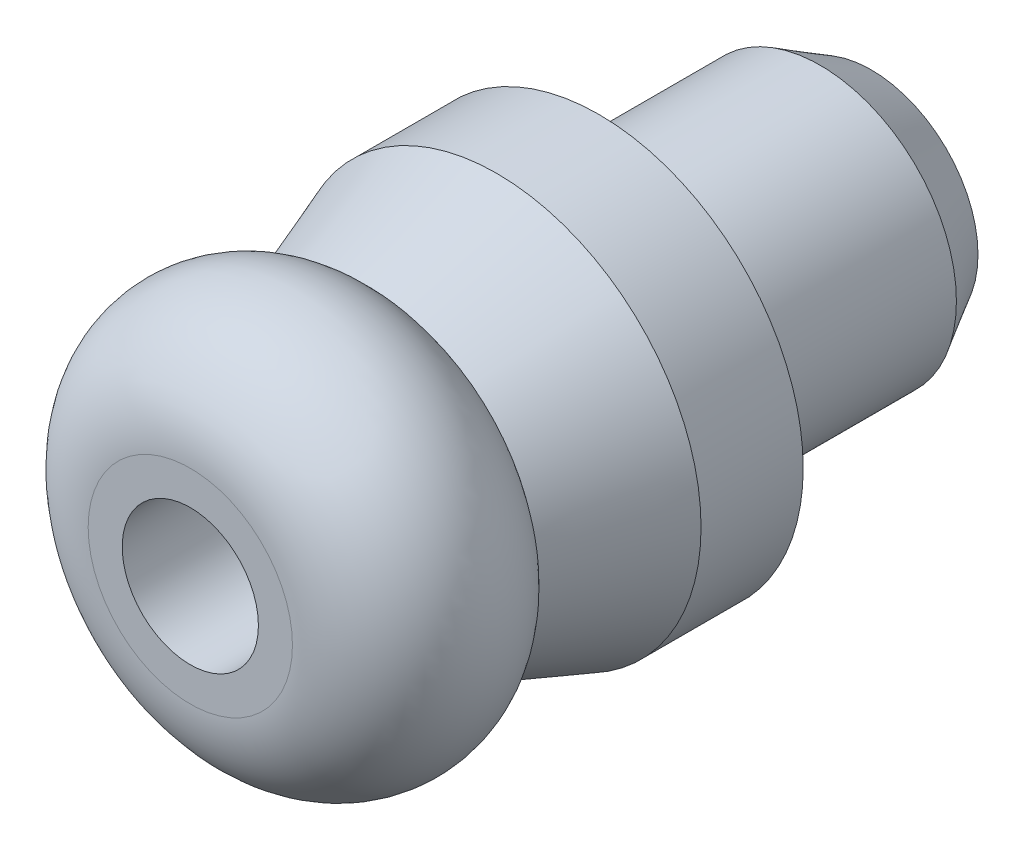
ISO-10303-21;
HEADER;
FILE_DESCRIPTION(('STEP AP214'),'2;1');
FILE_NAME('part.step','',(''),(''),'','','');
FILE_SCHEMA(('AUTOMOTIVE_DESIGN { 1 0 10303 214 1 1 1 1 }'));
ENDSEC;
DATA;
#1=APPLICATION_CONTEXT('core data for automotive mechanical design processes');
#2=APPLICATION_PROTOCOL_DEFINITION('international standard','automotive_design',2000,#1);
#3=PRODUCT_CONTEXT('',#1,'mechanical');
#4=PRODUCT('Part','Part','',(#3));
#5=PRODUCT_RELATED_PRODUCT_CATEGORY('part','',(#4));
#6=PRODUCT_DEFINITION_FORMATION('','',#4);
#7=PRODUCT_DEFINITION_CONTEXT('part definition',#1,'design');
#8=PRODUCT_DEFINITION('design','',#6,#7);
#9=PRODUCT_DEFINITION_SHAPE('','',#8);
#10=(LENGTH_UNIT() NAMED_UNIT(*) SI_UNIT(.MILLI.,.METRE.));
#11=(NAMED_UNIT(*) PLANE_ANGLE_UNIT() SI_UNIT($,.RADIAN.));
#12=(NAMED_UNIT(*) SI_UNIT($,.STERADIAN.) SOLID_ANGLE_UNIT());
#13=UNCERTAINTY_MEASURE_WITH_UNIT(LENGTH_MEASURE(1.E-05),#10,'distance_accuracy_value','');
#14=(GEOMETRIC_REPRESENTATION_CONTEXT(3) GLOBAL_UNCERTAINTY_ASSIGNED_CONTEXT((#13)) GLOBAL_UNIT_ASSIGNED_CONTEXT((#10,
#11,#12)) REPRESENTATION_CONTEXT('',''));
#15=CARTESIAN_POINT('',(0.,0.,0.));
#16=DIRECTION('',(0.,0.,1.));
#17=DIRECTION('',(1.,0.,0.));
#18=AXIS2_PLACEMENT_3D('',#15,#16,#17);
#19=CARTESIAN_POINT('',(0.,2.,4.));
#20=DIRECTION('',(0.,0.,1.));
#21=DIRECTION('',(1.,0.,0.));
#22=AXIS2_PLACEMENT_3D('',#19,#20,#21);
#23=PLANE('',#22);
#24=CARTESIAN_POINT('',(0.,0.,4.));
#25=DIRECTION('',(0.,0.,1.));
#26=DIRECTION('',(1.,0.,0.));
#27=AXIS2_PLACEMENT_3D('',#24,#25,#26);
#28=CIRCLE('',#27,2.);
#29=CARTESIAN_POINT('',(2.,0.,4.));
#30=VERTEX_POINT('',#29);
#31=EDGE_CURVE('E8',#30,#30,#28,.T.);
#32=ORIENTED_EDGE('',*,*,#31,.T.);
#33=EDGE_LOOP('',(#32));
#34=FACE_BOUND('',#33,.T.);
#35=ADVANCED_FACE('F12',(#34),#23,.T.);
#36=CARTESIAN_POINT('',(0.,0.,26.3638330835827));
#37=DIRECTION('',(0.,0.,1.));
#38=DIRECTION('',(1.,0.,0.));
#39=AXIS2_PLACEMENT_3D('',#36,#37,#38);
#40=CYLINDRICAL_SURFACE('',#39,2.);
#41=CARTESIAN_POINT('',(0.,0.,12.));
#42=DIRECTION('',(0.,0.,1.));
#43=DIRECTION('',(1.,0.,0.));
#44=AXIS2_PLACEMENT_3D('',#41,#42,#43);
#45=CIRCLE('',#44,2.);
#46=CARTESIAN_POINT('',(2.,0.,12.));
#47=VERTEX_POINT('',#46);
#48=EDGE_CURVE('E18',#47,#47,#45,.T.);
#49=ORIENTED_EDGE('',*,*,#48,.T.);
#50=EDGE_LOOP('',(#49));
#51=FACE_BOUND('',#50,.T.);
#52=ORIENTED_EDGE('',*,*,#31,.F.);
#53=EDGE_LOOP('',(#52));
#54=FACE_BOUND('',#53,.T.);
#55=ADVANCED_FACE('F60',(#51,#54),#40,.F.);
#56=CARTESIAN_POINT('',(0.,3.,12.));
#57=DIRECTION('',(0.,0.,1.));
#58=DIRECTION('',(1.,0.,0.));
#59=AXIS2_PLACEMENT_3D('',#56,#57,#58);
#60=PLANE('',#59);
#61=CARTESIAN_POINT('',(0.,0.,12.));
#62=DIRECTION('',(0.,0.,1.));
#63=DIRECTION('',(1.,0.,0.));
#64=AXIS2_PLACEMENT_3D('',#61,#62,#63);
#65=CIRCLE('',#64,3.);
#66=CARTESIAN_POINT('',(3.,0.,12.));
#67=VERTEX_POINT('',#66);
#68=EDGE_CURVE('E22',#67,#67,#65,.T.);
#69=ORIENTED_EDGE('',*,*,#68,.T.);
#70=EDGE_LOOP('',(#69));
#71=FACE_BOUND('',#70,.T.);
#72=ORIENTED_EDGE('',*,*,#48,.F.);
#73=EDGE_LOOP('',(#72));
#74=FACE_BOUND('',#73,.T.);
#75=ADVANCED_FACE('F64',(#71,#74),#60,.T.);
#76=CARTESIAN_POINT('',(0.,0.,8.99999999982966));
#77=DIRECTION('',(0.,0.,1.));
#78=DIRECTION('',(1.,0.,0.));
#79=AXIS2_PLACEMENT_3D('',#76,#77,#78);
#80=DEGENERATE_TOROIDAL_SURFACE('',#79,2.99999999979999,3.00000000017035,.T.);
#81=CARTESIAN_POINT('',(0.,0.,6.53691825));
#82=DIRECTION('',(0.,0.,1.));
#83=DIRECTION('',(1.,0.,0.));
#84=AXIS2_PLACEMENT_3D('',#81,#82,#83);
#85=CIRCLE('',#84,4.712667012);
#86=CARTESIAN_POINT('',(4.712667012,0.,6.53691825));
#87=VERTEX_POINT('',#86);
#88=EDGE_CURVE('E26',#87,#87,#85,.T.);
#89=ORIENTED_EDGE('',*,*,#88,.T.);
#90=EDGE_LOOP('',(#89));
#91=FACE_BOUND('',#90,.T.);
#92=ORIENTED_EDGE('',*,*,#68,.F.);
#93=EDGE_LOOP('',(#92));
#94=FACE_BOUND('',#93,.T.);
#95=ADVANCED_FACE('F68',(#91,#94),#80,.T.);
#96=CARTESIAN_POINT('',(0.,0.,6.53691825));
#97=DIRECTION('',(0.,0.,-1.));
#98=DIRECTION('',(-1.,0.,0.));
#99=AXIS2_PLACEMENT_3D('',#96,#97,#98);
#100=CONICAL_SURFACE('',#99,4.712667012,0.349065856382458);
#101=CARTESIAN_POINT('',(0.,0.,3.));
#102=DIRECTION('',(0.,0.,1.));
#103=DIRECTION('',(1.,0.,0.));
#104=AXIS2_PLACEMENT_3D('',#101,#102,#103);
#105=CIRCLE('',#104,6.);
#106=CARTESIAN_POINT('',(6.,0.,3.));
#107=VERTEX_POINT('',#106);
#108=EDGE_CURVE('E31',#107,#107,#105,.T.);
#109=ORIENTED_EDGE('',*,*,#108,.T.);
#110=EDGE_LOOP('',(#109));
#111=FACE_BOUND('',#110,.T.);
#112=ORIENTED_EDGE('',*,*,#88,.F.);
#113=EDGE_LOOP('',(#112));
#114=FACE_BOUND('',#113,.T.);
#115=ADVANCED_FACE('F75',(#111,#114),#100,.T.);
#116=CARTESIAN_POINT('',(0.,0.,26.3638330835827));
#117=DIRECTION('',(0.,0.,1.));
#118=DIRECTION('',(1.,0.,0.));
#119=AXIS2_PLACEMENT_3D('',#116,#117,#118);
#120=CYLINDRICAL_SURFACE('',#119,6.);
#121=CARTESIAN_POINT('',(0.,0.,0.));
#122=DIRECTION('',(0.,0.,1.));
#123=DIRECTION('',(1.,0.,0.));
#124=AXIS2_PLACEMENT_3D('',#121,#122,#123);
#125=CIRCLE('',#124,6.);
#126=CARTESIAN_POINT('',(6.,0.,0.));
#127=VERTEX_POINT('',#126);
#128=EDGE_CURVE('E34',#127,#127,#125,.T.);
#129=ORIENTED_EDGE('',*,*,#128,.T.);
#130=EDGE_LOOP('',(#129));
#131=FACE_BOUND('',#130,.T.);
#132=ORIENTED_EDGE('',*,*,#108,.F.);
#133=EDGE_LOOP('',(#132));
#134=FACE_BOUND('',#133,.T.);
#135=ADVANCED_FACE('F79',(#131,#134),#120,.T.);
#136=CARTESIAN_POINT('',(0.,4.,0.));
#137=DIRECTION('',(0.,0.,-1.));
#138=DIRECTION('',(-1.,0.,0.));
#139=AXIS2_PLACEMENT_3D('',#136,#137,#138);
#140=PLANE('',#139);
#141=CARTESIAN_POINT('',(0.,0.,0.));
#142=DIRECTION('',(0.,0.,1.));
#143=DIRECTION('',(1.,0.,0.));
#144=AXIS2_PLACEMENT_3D('',#141,#142,#143);
#145=CIRCLE('',#144,4.);
#146=CARTESIAN_POINT('',(4.,0.,0.));
#147=VERTEX_POINT('',#146);
#148=EDGE_CURVE('E37',#147,#147,#145,.T.);
#149=ORIENTED_EDGE('',*,*,#148,.T.);
#150=EDGE_LOOP('',(#149));
#151=FACE_BOUND('',#150,.T.);
#152=ORIENTED_EDGE('',*,*,#128,.F.);
#153=EDGE_LOOP('',(#152));
#154=FACE_BOUND('',#153,.T.);
#155=ADVANCED_FACE('F83',(#151,#154),#140,.T.);
#156=CARTESIAN_POINT('',(0.,0.,26.3638330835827));
#157=DIRECTION('',(0.,0.,1.));
#158=DIRECTION('',(1.,0.,0.));
#159=AXIS2_PLACEMENT_3D('',#156,#157,#158);
#160=CYLINDRICAL_SURFACE('',#159,4.);
#161=CARTESIAN_POINT('',(0.,0.,-6.5));
#162=DIRECTION('',(0.,0.,1.));
#163=DIRECTION('',(1.,0.,0.));
#164=AXIS2_PLACEMENT_3D('',#161,#162,#163);
#165=CIRCLE('',#164,4.);
#166=CARTESIAN_POINT('',(4.,0.,-6.5));
#167=VERTEX_POINT('',#166);
#168=EDGE_CURVE('E40',#167,#167,#165,.T.);
#169=ORIENTED_EDGE('',*,*,#168,.T.);
#170=EDGE_LOOP('',(#169));
#171=FACE_BOUND('',#170,.T.);
#172=ORIENTED_EDGE('',*,*,#148,.F.);
#173=EDGE_LOOP('',(#172));
#174=FACE_BOUND('',#173,.T.);
#175=ADVANCED_FACE('F57',(#171,#174),#160,.T.);
#176=CARTESIAN_POINT('',(0.,0.,-6.5));
#177=DIRECTION('',(0.,0.,1.));
#178=DIRECTION('',(1.,0.,0.));
#179=AXIS2_PLACEMENT_3D('',#176,#177,#178);
#180=CONICAL_SURFACE('',#179,4.,0.523598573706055);
#181=CARTESIAN_POINT('',(0.,0.,-8.));
#182=DIRECTION('',(0.,0.,1.));
#183=DIRECTION('',(1.,0.,0.));
#184=AXIS2_PLACEMENT_3D('',#181,#182,#183);
#185=CIRCLE('',#184,3.133975);
#186=CARTESIAN_POINT('',(3.133975,0.,-8.));
#187=VERTEX_POINT('',#186);
#188=EDGE_CURVE('E43',#187,#187,#185,.T.);
#189=ORIENTED_EDGE('',*,*,#188,.T.);
#190=EDGE_LOOP('',(#189));
#191=FACE_BOUND('',#190,.T.);
#192=ORIENTED_EDGE('',*,*,#168,.F.);
#193=EDGE_LOOP('',(#192));
#194=FACE_BOUND('',#193,.T.);
#195=ADVANCED_FACE('F47',(#191,#194),#180,.T.);
#196=CARTESIAN_POINT('',(0.,0.,-8.));
#197=DIRECTION('',(0.,0.,-1.));
#198=DIRECTION('',(-1.,0.,0.));
#199=AXIS2_PLACEMENT_3D('',#196,#197,#198);
#200=PLANE('',#199);
#201=ORIENTED_EDGE('',*,*,#188,.F.);
#202=EDGE_LOOP('',(#201));
#203=FACE_BOUND('',#202,.T.);
#204=ADVANCED_FACE('F50',(#203),#200,.T.);
#205=CLOSED_SHELL('',(#35,#55,#75,#95,#115,#135,#155,#175,#195,#204));
#206=MANIFOLD_SOLID_BREP('B1',#205);
#207=ADVANCED_BREP_SHAPE_REPRESENTATION('',(#18,#206),#14);
#208=SHAPE_DEFINITION_REPRESENTATION(#9,#207);
ENDSEC;
END-ISO-10303-21;
